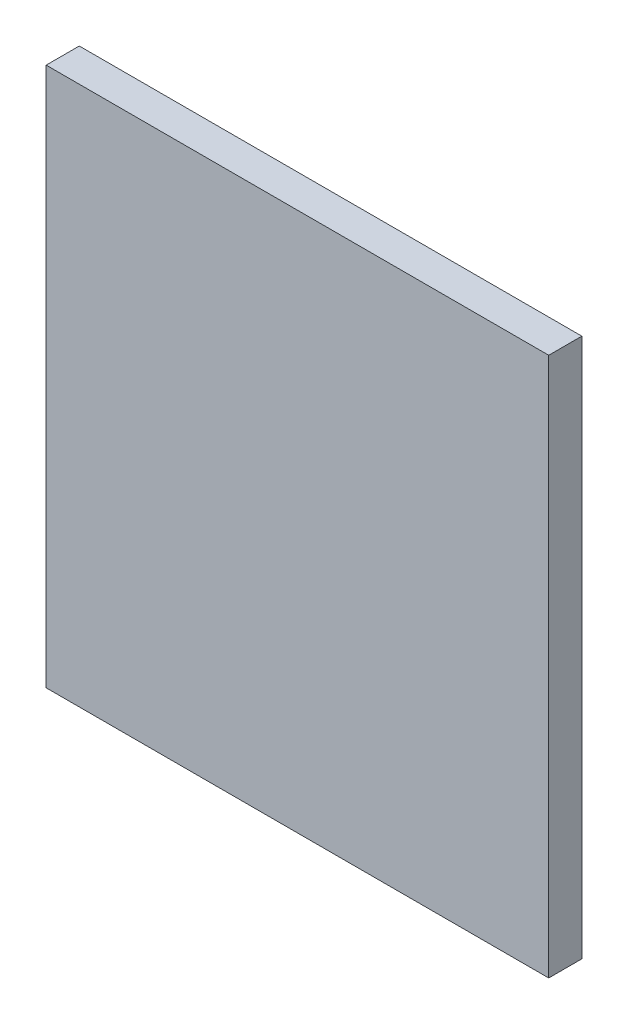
ISO-10303-21;
HEADER;
FILE_DESCRIPTION(('STEP AP214'),'2;1');
FILE_NAME('part.step','',(''),(''),'','','');
FILE_SCHEMA(('AUTOMOTIVE_DESIGN { 1 0 10303 214 1 1 1 1 }'));
ENDSEC;
DATA;
#1=APPLICATION_CONTEXT('core data for automotive mechanical design processes');
#2=APPLICATION_PROTOCOL_DEFINITION('international standard','automotive_design',2000,#1);
#3=PRODUCT_CONTEXT('',#1,'mechanical');
#4=PRODUCT('Part','Part','',(#3));
#5=PRODUCT_RELATED_PRODUCT_CATEGORY('part','',(#4));
#6=PRODUCT_DEFINITION_FORMATION('','',#4);
#7=PRODUCT_DEFINITION_CONTEXT('part definition',#1,'design');
#8=PRODUCT_DEFINITION('design','',#6,#7);
#9=PRODUCT_DEFINITION_SHAPE('','',#8);
#10=(LENGTH_UNIT() NAMED_UNIT(*) SI_UNIT(.MILLI.,.METRE.));
#11=(NAMED_UNIT(*) PLANE_ANGLE_UNIT() SI_UNIT($,.RADIAN.));
#12=(NAMED_UNIT(*) SI_UNIT($,.STERADIAN.) SOLID_ANGLE_UNIT());
#13=UNCERTAINTY_MEASURE_WITH_UNIT(LENGTH_MEASURE(1.E-05),#10,'distance_accuracy_value','');
#14=(GEOMETRIC_REPRESENTATION_CONTEXT(3) GLOBAL_UNCERTAINTY_ASSIGNED_CONTEXT((#13)) GLOBAL_UNIT_ASSIGNED_CONTEXT((#10,
#11,#12)) REPRESENTATION_CONTEXT('',''));
#15=CARTESIAN_POINT('',(0.,0.,0.));
#16=DIRECTION('',(0.,0.,1.));
#17=DIRECTION('',(1.,0.,0.));
#18=AXIS2_PLACEMENT_3D('',#15,#16,#17);
#19=CARTESIAN_POINT('',(0.,480.,-27.));
#20=DIRECTION('',(-1.,0.,0.));
#21=DIRECTION('',(0.,0.,1.));
#22=AXIS2_PLACEMENT_3D('',#19,#20,#21);
#23=PLANE('',#22);
#24=DIRECTION('',(0.,-1.,0.));
#25=VECTOR('',#24,1.);
#26=CARTESIAN_POINT('',(0.,480.,0.));
#27=LINE('',#26,#25);
#28=CARTESIAN_POINT('',(0.,480.,0.));
#29=VERTEX_POINT('',#28);
#30=CARTESIAN_POINT('',(0.,40.,0.));
#31=VERTEX_POINT('',#30);
#32=EDGE_CURVE('E97',#29,#31,#27,.T.);
#33=ORIENTED_EDGE('',*,*,#32,.F.);
#34=DIRECTION('',(0.,0.,1.));
#35=VECTOR('',#34,1.);
#36=CARTESIAN_POINT('',(0.,480.,-27.));
#37=LINE('',#36,#35);
#38=CARTESIAN_POINT('',(0.,480.,-27.));
#39=VERTEX_POINT('',#38);
#40=EDGE_CURVE('E11',#39,#29,#37,.T.);
#41=ORIENTED_EDGE('',*,*,#40,.F.);
#42=DIRECTION('',(0.,-1.,0.));
#43=VECTOR('',#42,1.);
#44=CARTESIAN_POINT('',(0.,480.,-27.));
#45=LINE('',#44,#43);
#46=CARTESIAN_POINT('',(0.,40.,-27.));
#47=VERTEX_POINT('',#46);
#48=EDGE_CURVE('E91',#39,#47,#45,.T.);
#49=ORIENTED_EDGE('',*,*,#48,.T.);
#50=DIRECTION('',(0.,0.,1.));
#51=VECTOR('',#50,1.);
#52=CARTESIAN_POINT('',(0.,40.,-27.));
#53=LINE('',#52,#51);
#54=EDGE_CURVE('E36',#47,#31,#53,.T.);
#55=ORIENTED_EDGE('',*,*,#54,.T.);
#56=EDGE_LOOP('',(#33,#41,#49,#55));
#57=FACE_BOUND('',#56,.T.);
#58=ADVANCED_FACE('F33',(#57),#23,.T.);
#59=CARTESIAN_POINT('',(0.,480.,-27.));
#60=DIRECTION('',(0.,1.,0.));
#61=DIRECTION('',(0.,0.,1.));
#62=AXIS2_PLACEMENT_3D('',#59,#60,#61);
#63=PLANE('',#62);
#64=DIRECTION('',(-1.,0.,0.));
#65=VECTOR('',#64,1.);
#66=CARTESIAN_POINT('',(0.,480.,0.));
#67=LINE('',#66,#65);
#68=CARTESIAN_POINT('',(410.,480.,0.));
#69=VERTEX_POINT('',#68);
#70=EDGE_CURVE('E93',#69,#29,#67,.T.);
#71=ORIENTED_EDGE('',*,*,#70,.F.);
#72=DIRECTION('',(0.,0.,1.));
#73=VECTOR('',#72,1.);
#74=CARTESIAN_POINT('',(410.,480.,-27.));
#75=LINE('',#74,#73);
#76=CARTESIAN_POINT('',(410.,480.,-27.));
#77=VERTEX_POINT('',#76);
#78=EDGE_CURVE('E42',#77,#69,#75,.T.);
#79=ORIENTED_EDGE('',*,*,#78,.F.);
#80=DIRECTION('',(-1.,0.,0.));
#81=VECTOR('',#80,1.);
#82=CARTESIAN_POINT('',(0.,480.,-27.));
#83=LINE('',#82,#81);
#84=EDGE_CURVE('E88',#77,#39,#83,.T.);
#85=ORIENTED_EDGE('',*,*,#84,.T.);
#86=ORIENTED_EDGE('',*,*,#40,.T.);
#87=EDGE_LOOP('',(#71,#79,#85,#86));
#88=FACE_BOUND('',#87,.T.);
#89=ADVANCED_FACE('F107',(#88),#63,.T.);
#90=CARTESIAN_POINT('',(410.,480.,-27.));
#91=DIRECTION('',(1.,0.,0.));
#92=DIRECTION('',(0.,0.,-1.));
#93=AXIS2_PLACEMENT_3D('',#90,#91,#92);
#94=PLANE('',#93);
#95=DIRECTION('',(0.,1.,0.));
#96=VECTOR('',#95,1.);
#97=CARTESIAN_POINT('',(410.,480.,0.));
#98=LINE('',#97,#96);
#99=CARTESIAN_POINT('',(410.,40.,0.));
#100=VERTEX_POINT('',#99);
#101=EDGE_CURVE('E83',#100,#69,#98,.T.);
#102=ORIENTED_EDGE('',*,*,#101,.F.);
#103=DIRECTION('',(0.,0.,1.));
#104=VECTOR('',#103,1.);
#105=CARTESIAN_POINT('',(410.,40.,-27.));
#106=LINE('',#105,#104);
#107=CARTESIAN_POINT('',(410.,40.,-27.));
#108=VERTEX_POINT('',#107);
#109=EDGE_CURVE('E78',#108,#100,#106,.T.);
#110=ORIENTED_EDGE('',*,*,#109,.F.);
#111=DIRECTION('',(0.,1.,0.));
#112=VECTOR('',#111,1.);
#113=CARTESIAN_POINT('',(410.,480.,-27.));
#114=LINE('',#113,#112);
#115=EDGE_CURVE('E81',#108,#77,#114,.T.);
#116=ORIENTED_EDGE('',*,*,#115,.T.);
#117=ORIENTED_EDGE('',*,*,#78,.T.);
#118=EDGE_LOOP('',(#102,#110,#116,#117));
#119=FACE_BOUND('',#118,.T.);
#120=ADVANCED_FACE('F80',(#119),#94,.T.);
#121=CARTESIAN_POINT('',(0.,40.,-27.));
#122=DIRECTION('',(0.,-1.,0.));
#123=DIRECTION('',(0.,0.,-1.));
#124=AXIS2_PLACEMENT_3D('',#121,#122,#123);
#125=PLANE('',#124);
#126=DIRECTION('',(1.,0.,0.));
#127=VECTOR('',#126,1.);
#128=CARTESIAN_POINT('',(0.,40.,0.));
#129=LINE('',#128,#127);
#130=EDGE_CURVE('E100',#31,#100,#129,.T.);
#131=ORIENTED_EDGE('',*,*,#130,.F.);
#132=ORIENTED_EDGE('',*,*,#54,.F.);
#133=DIRECTION('',(1.,0.,0.));
#134=VECTOR('',#133,1.);
#135=CARTESIAN_POINT('',(0.,40.,-27.));
#136=LINE('',#135,#134);
#137=EDGE_CURVE('E87',#47,#108,#136,.T.);
#138=ORIENTED_EDGE('',*,*,#137,.T.);
#139=ORIENTED_EDGE('',*,*,#109,.T.);
#140=EDGE_LOOP('',(#131,#132,#138,#139));
#141=FACE_BOUND('',#140,.T.);
#142=ADVANCED_FACE('F90',(#141),#125,.T.);
#143=CARTESIAN_POINT('',(0.,0.,-27.));
#144=DIRECTION('',(0.,0.,1.));
#145=DIRECTION('',(1.,0.,0.));
#146=AXIS2_PLACEMENT_3D('',#143,#144,#145);
#147=PLANE('',#146);
#148=ORIENTED_EDGE('',*,*,#48,.F.);
#149=ORIENTED_EDGE('',*,*,#84,.F.);
#150=ORIENTED_EDGE('',*,*,#115,.F.);
#151=ORIENTED_EDGE('',*,*,#137,.F.);
#152=EDGE_LOOP('',(#148,#149,#150,#151));
#153=FACE_BOUND('',#152,.T.);
#154=ADVANCED_FACE('F86',(#153),#147,.F.);
#155=CARTESIAN_POINT('',(0.,0.,0.));
#156=DIRECTION('',(0.,0.,1.));
#157=DIRECTION('',(1.,0.,0.));
#158=AXIS2_PLACEMENT_3D('',#155,#156,#157);
#159=PLANE('',#158);
#160=ORIENTED_EDGE('',*,*,#32,.T.);
#161=ORIENTED_EDGE('',*,*,#130,.T.);
#162=ORIENTED_EDGE('',*,*,#101,.T.);
#163=ORIENTED_EDGE('',*,*,#70,.T.);
#164=EDGE_LOOP('',(#160,#161,#162,#163));
#165=FACE_BOUND('',#164,.T.);
#166=ADVANCED_FACE('F106',(#165),#159,.T.);
#167=CLOSED_SHELL('',(#58,#89,#120,#142,#154,#166));
#168=MANIFOLD_SOLID_BREP('B2',#167);
#169=ADVANCED_BREP_SHAPE_REPRESENTATION('',(#18,#168),#14);
#170=SHAPE_DEFINITION_REPRESENTATION(#9,#169);
ENDSEC;
END-ISO-10303-21;
